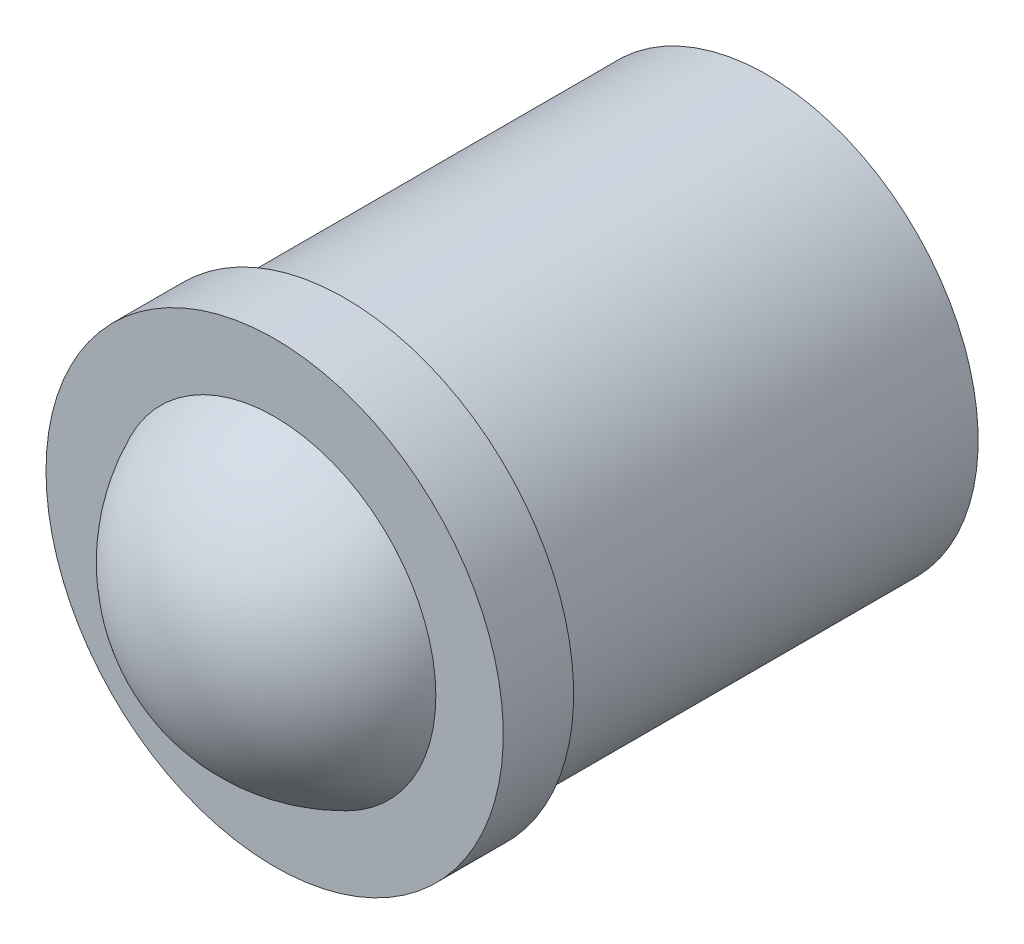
ISO-10303-21;
HEADER;
FILE_DESCRIPTION(('STEP AP214'),'2;1');
FILE_NAME('part.step','',(''),(''),'','','');
FILE_SCHEMA(('AUTOMOTIVE_DESIGN { 1 0 10303 214 1 1 1 1 }'));
ENDSEC;
DATA;
#1=APPLICATION_CONTEXT('core data for automotive mechanical design processes');
#2=APPLICATION_PROTOCOL_DEFINITION('international standard','automotive_design',2000,#1);
#3=PRODUCT_CONTEXT('',#1,'mechanical');
#4=PRODUCT('Part','Part','',(#3));
#5=PRODUCT_RELATED_PRODUCT_CATEGORY('part','',(#4));
#6=PRODUCT_DEFINITION_FORMATION('','',#4);
#7=PRODUCT_DEFINITION_CONTEXT('part definition',#1,'design');
#8=PRODUCT_DEFINITION('design','',#6,#7);
#9=PRODUCT_DEFINITION_SHAPE('','',#8);
#10=(LENGTH_UNIT() NAMED_UNIT(*) SI_UNIT(.MILLI.,.METRE.));
#11=(NAMED_UNIT(*) PLANE_ANGLE_UNIT() SI_UNIT($,.RADIAN.));
#12=(NAMED_UNIT(*) SI_UNIT($,.STERADIAN.) SOLID_ANGLE_UNIT());
#13=UNCERTAINTY_MEASURE_WITH_UNIT(LENGTH_MEASURE(1.E-05),#10,'distance_accuracy_value','');
#14=(GEOMETRIC_REPRESENTATION_CONTEXT(3) GLOBAL_UNCERTAINTY_ASSIGNED_CONTEXT((#13)) GLOBAL_UNIT_ASSIGNED_CONTEXT((#10,
#11,#12)) REPRESENTATION_CONTEXT('',''));
#15=CARTESIAN_POINT('',(0.,0.,0.));
#16=DIRECTION('',(0.,0.,1.));
#17=DIRECTION('',(1.,0.,0.));
#18=AXIS2_PLACEMENT_3D('',#15,#16,#17);
#19=CARTESIAN_POINT('',(0.,0.,0.));
#20=DIRECTION('',(-1.,0.,0.));
#21=DIRECTION('',(0.,0.,-1.));
#22=AXIS2_PLACEMENT_3D('',#19,#20,#21);
#23=SPHERICAL_SURFACE('',#22,2.5);
#24=CARTESIAN_POINT('',(0.,0.,0.));
#25=DIRECTION('',(0.,0.,1.));
#26=DIRECTION('',(-1.,0.,0.));
#27=AXIS2_PLACEMENT_3D('',#24,#25,#26);
#28=SPHERICAL_SURFACE('',#27,2.5);
#29=CARTESIAN_POINT('',(0.,0.,1.));
#30=DIRECTION('',(0.,0.,1.));
#31=DIRECTION('',(-1.,0.,0.));
#32=AXIS2_PLACEMENT_3D('',#29,#30,#31);
#33=CIRCLE('',#32,2.29128784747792);
#34=CARTESIAN_POINT('',(-2.29128784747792,0.,1.));
#35=VERTEX_POINT('',#34);
#36=EDGE_CURVE('E31',#35,#35,#33,.T.);
#37=ORIENTED_EDGE('',*,*,#36,.T.);
#38=EDGE_LOOP('',(#37));
#39=FACE_BOUND('',#38,.T.);
#40=ADVANCED_FACE('F12',(#39),#28,.T.);
#41=CARTESIAN_POINT('',(0.,0.,-6.));
#42=DIRECTION('',(0.,0.,1.));
#43=DIRECTION('',(-1.,0.,0.));
#44=AXIS2_PLACEMENT_3D('',#41,#42,#43);
#45=PLANE('',#44);
#46=CARTESIAN_POINT('',(0.,0.,-6.));
#47=DIRECTION('',(0.,0.,1.));
#48=DIRECTION('',(-1.,0.,0.));
#49=AXIS2_PLACEMENT_3D('',#46,#47,#48);
#50=CIRCLE('',#49,3.);
#51=CARTESIAN_POINT('',(-3.,0.,-6.));
#52=VERTEX_POINT('',#51);
#53=EDGE_CURVE('E8',#52,#52,#50,.T.);
#54=ORIENTED_EDGE('',*,*,#53,.F.);
#55=EDGE_LOOP('',(#54));
#56=FACE_BOUND('',#55,.T.);
#57=ADVANCED_FACE('F57',(#56),#45,.F.);
#58=CARTESIAN_POINT('',(0.,0.,5.));
#59=DIRECTION('',(0.,0.,1.));
#60=DIRECTION('',(-1.,0.,0.));
#61=AXIS2_PLACEMENT_3D('',#58,#59,#60);
#62=CYLINDRICAL_SURFACE('',#61,3.);
#63=CARTESIAN_POINT('',(0.,0.,0.));
#64=DIRECTION('',(0.,0.,1.));
#65=DIRECTION('',(-1.,0.,0.));
#66=AXIS2_PLACEMENT_3D('',#63,#64,#65);
#67=CIRCLE('',#66,3.);
#68=CARTESIAN_POINT('',(-3.,0.,0.));
#69=VERTEX_POINT('',#68);
#70=EDGE_CURVE('E18',#69,#69,#67,.T.);
#71=ORIENTED_EDGE('',*,*,#70,.F.);
#72=EDGE_LOOP('',(#71));
#73=FACE_BOUND('',#72,.T.);
#74=ORIENTED_EDGE('',*,*,#53,.T.);
#75=EDGE_LOOP('',(#74));
#76=FACE_BOUND('',#75,.T.);
#77=ADVANCED_FACE('F50',(#73,#76),#62,.T.);
#78=CARTESIAN_POINT('',(0.,-3.,0.));
#79=DIRECTION('',(0.,0.,1.));
#80=DIRECTION('',(-1.,0.,0.));
#81=AXIS2_PLACEMENT_3D('',#78,#79,#80);
#82=PLANE('',#81);
#83=CARTESIAN_POINT('',(0.,0.,0.));
#84=DIRECTION('',(0.,0.,1.));
#85=DIRECTION('',(-1.,0.,0.));
#86=AXIS2_PLACEMENT_3D('',#83,#84,#85);
#87=CIRCLE('',#86,3.25);
#88=CARTESIAN_POINT('',(-3.25,0.,0.));
#89=VERTEX_POINT('',#88);
#90=EDGE_CURVE('E22',#89,#89,#87,.T.);
#91=ORIENTED_EDGE('',*,*,#90,.F.);
#92=EDGE_LOOP('',(#91));
#93=FACE_BOUND('',#92,.T.);
#94=ORIENTED_EDGE('',*,*,#70,.T.);
#95=EDGE_LOOP('',(#94));
#96=FACE_BOUND('',#95,.T.);
#97=ADVANCED_FACE('F45',(#93,#96),#82,.F.);
#98=CARTESIAN_POINT('',(0.,0.,5.));
#99=DIRECTION('',(0.,0.,1.));
#100=DIRECTION('',(-1.,0.,0.));
#101=AXIS2_PLACEMENT_3D('',#98,#99,#100);
#102=CYLINDRICAL_SURFACE('',#101,3.25);
#103=CARTESIAN_POINT('',(0.,0.,1.));
#104=DIRECTION('',(0.,0.,1.));
#105=DIRECTION('',(-1.,0.,0.));
#106=AXIS2_PLACEMENT_3D('',#103,#104,#105);
#107=CIRCLE('',#106,3.25);
#108=CARTESIAN_POINT('',(-3.25,0.,1.));
#109=VERTEX_POINT('',#108);
#110=EDGE_CURVE('E26',#109,#109,#107,.T.);
#111=ORIENTED_EDGE('',*,*,#110,.F.);
#112=EDGE_LOOP('',(#111));
#113=FACE_BOUND('',#112,.T.);
#114=ORIENTED_EDGE('',*,*,#90,.T.);
#115=EDGE_LOOP('',(#114));
#116=FACE_BOUND('',#115,.T.);
#117=ADVANCED_FACE('F39',(#113,#116),#102,.T.);
#118=CARTESIAN_POINT('',(0.,-3.25,1.));
#119=DIRECTION('',(0.,0.,-1.));
#120=DIRECTION('',(1.,0.,0.));
#121=AXIS2_PLACEMENT_3D('',#118,#119,#120);
#122=PLANE('',#121);
#123=ORIENTED_EDGE('',*,*,#36,.F.);
#124=EDGE_LOOP('',(#123));
#125=FACE_BOUND('',#124,.T.);
#126=ORIENTED_EDGE('',*,*,#110,.T.);
#127=EDGE_LOOP('',(#126));
#128=FACE_BOUND('',#127,.T.);
#129=ADVANCED_FACE('F36',(#125,#128),#122,.F.);
#130=CLOSED_SHELL('',(#40,#57,#77,#97,#117,#129));
#131=MANIFOLD_SOLID_BREP('B1',#130);
#132=ADVANCED_BREP_SHAPE_REPRESENTATION('',(#18,#131),#14);
#133=SHAPE_DEFINITION_REPRESENTATION(#9,#132);
ENDSEC;
END-ISO-10303-21;
